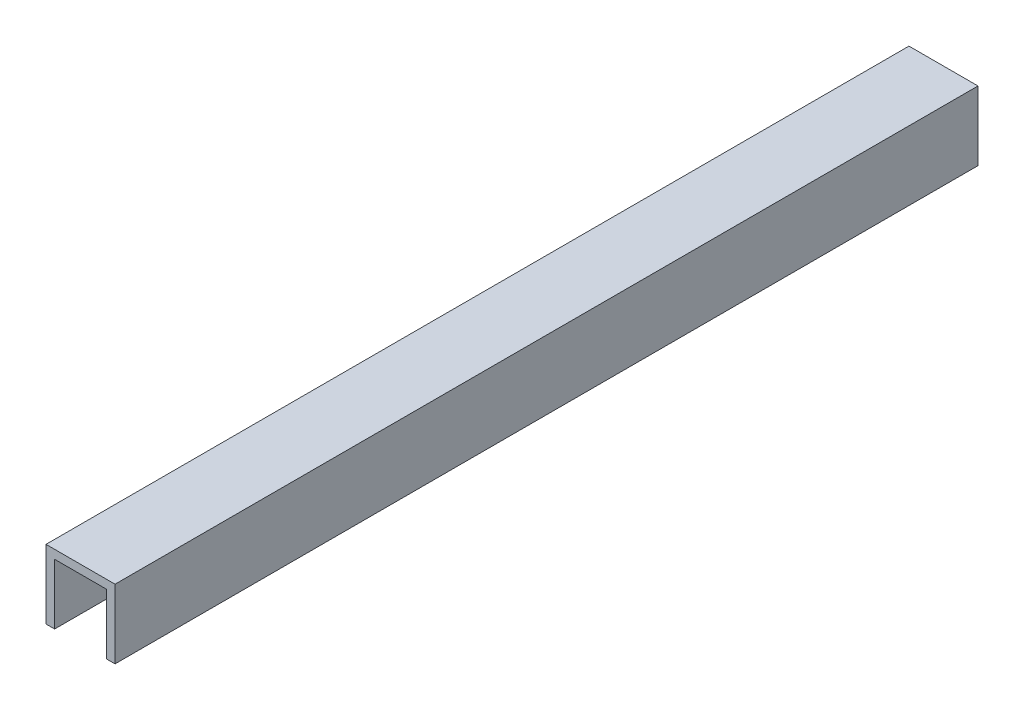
from build123d import *

# Parameters (mm, degrees)
SKIZZE1_W                       = 8
SKIZZE1_H                       = 8
AUFSATZ_LINEAR_AUSTRAGEN1_DEPTH = 50
WANDUNG1_T                      = -1


with BuildPart() as part:
    # Skizze1 → Aufsatz-Linear austragen1 (new, symmetric)
    with BuildSketch(Plane.XY):
        Rectangle(SKIZZE1_W, SKIZZE1_H)
    extrude(amount=AUFSATZ_LINEAR_AUSTRAGEN1_DEPTH, both=True)

    # Wandung1
    wandung1_openings = [part.faces().sort_by_distance(p)[0] for p in [
        (0, 0, 50),
        (0, 0, -50),
        (0, -4, 0),
    ]]
    offset(amount=WANDUNG1_T, openings=wandung1_openings, kind=Kind.INTERSECTION)


solid = part.part
